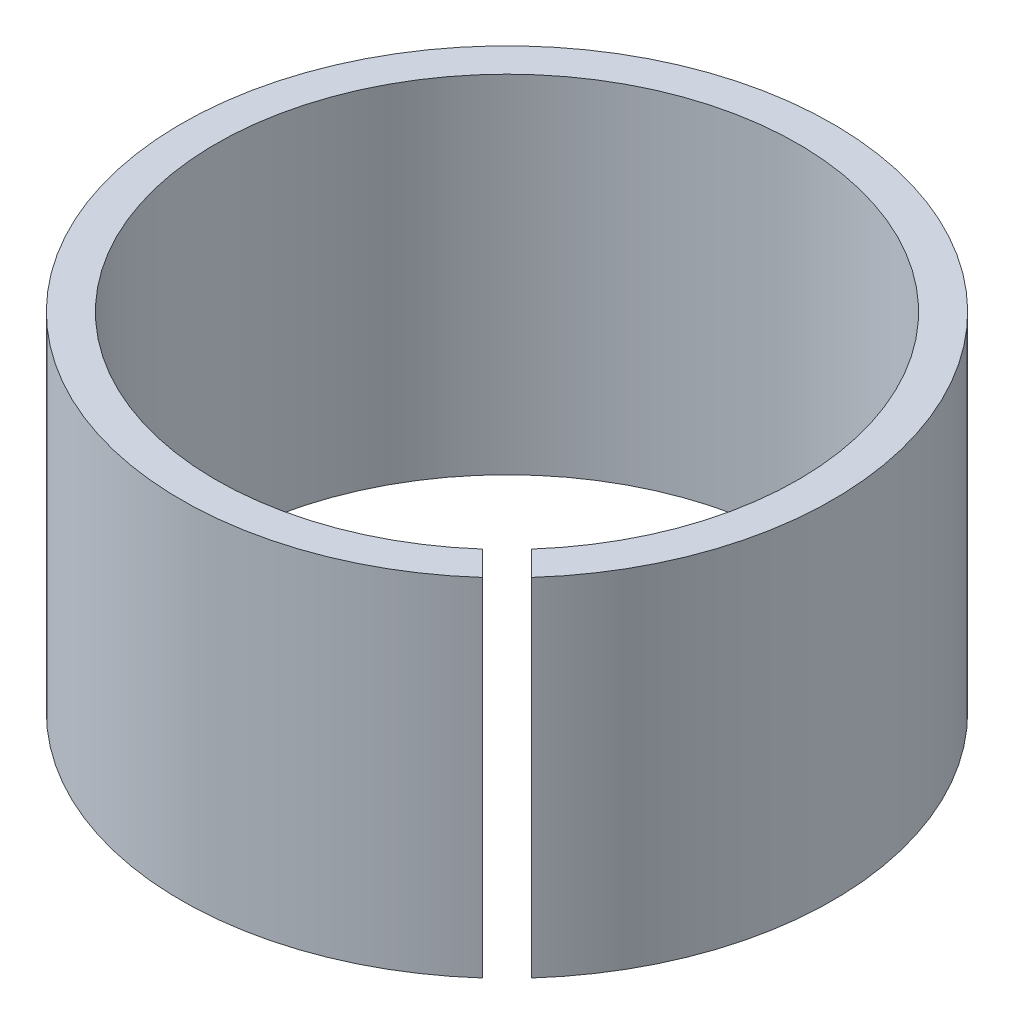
ISO-10303-21;
HEADER;
FILE_DESCRIPTION(('STEP AP214'),'2;1');
FILE_NAME('part.step','',(''),(''),'','','');
FILE_SCHEMA(('AUTOMOTIVE_DESIGN { 1 0 10303 214 1 1 1 1 }'));
ENDSEC;
DATA;
#1=APPLICATION_CONTEXT('core data for automotive mechanical design processes');
#2=APPLICATION_PROTOCOL_DEFINITION('international standard','automotive_design',2000,#1);
#3=PRODUCT_CONTEXT('',#1,'mechanical');
#4=PRODUCT('Part','Part','',(#3));
#5=PRODUCT_RELATED_PRODUCT_CATEGORY('part','',(#4));
#6=PRODUCT_DEFINITION_FORMATION('','',#4);
#7=PRODUCT_DEFINITION_CONTEXT('part definition',#1,'design');
#8=PRODUCT_DEFINITION('design','',#6,#7);
#9=PRODUCT_DEFINITION_SHAPE('','',#8);
#10=(LENGTH_UNIT() NAMED_UNIT(*) SI_UNIT(.MILLI.,.METRE.));
#11=(NAMED_UNIT(*) PLANE_ANGLE_UNIT() SI_UNIT($,.RADIAN.));
#12=(NAMED_UNIT(*) SI_UNIT($,.STERADIAN.) SOLID_ANGLE_UNIT());
#13=UNCERTAINTY_MEASURE_WITH_UNIT(LENGTH_MEASURE(1.E-05),#10,'distance_accuracy_value','');
#14=(GEOMETRIC_REPRESENTATION_CONTEXT(3) GLOBAL_UNCERTAINTY_ASSIGNED_CONTEXT((#13)) GLOBAL_UNIT_ASSIGNED_CONTEXT((#10,
#11,#12)) REPRESENTATION_CONTEXT('',''));
#15=CARTESIAN_POINT('',(0.,0.,0.));
#16=DIRECTION('',(0.,0.,1.));
#17=DIRECTION('',(1.,0.,0.));
#18=AXIS2_PLACEMENT_3D('',#15,#16,#17);
#19=CARTESIAN_POINT('',(0.,10.,0.));
#20=DIRECTION('',(0.,-1.,0.));
#21=DIRECTION('',(0.,0.,-1.));
#22=AXIS2_PLACEMENT_3D('',#19,#20,#21);
#23=CYLINDRICAL_SURFACE('',#22,9.39);
#24=CARTESIAN_POINT('',(0.,0.,0.));
#25=DIRECTION('',(0.,1.,0.));
#26=DIRECTION('',(0.,0.,1.));
#27=AXIS2_PLACEMENT_3D('',#24,#25,#26);
#28=CIRCLE('',#27,9.39);
#29=CARTESIAN_POINT('',(6.98386635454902,0.,6.27675957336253));
#30=VERTEX_POINT('',#29);
#31=CARTESIAN_POINT('',(6.2767595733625,0.,6.98386635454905));
#32=VERTEX_POINT('',#31);
#33=EDGE_CURVE('E75',#30,#32,#28,.T.);
#34=ORIENTED_EDGE('',*,*,#33,.T.);
#35=DIRECTION('',(0.,-1.,0.));
#36=VECTOR('',#35,1.);
#37=CARTESIAN_POINT('',(6.2767595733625,10.,6.98386635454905));
#38=LINE('',#37,#36);
#39=CARTESIAN_POINT('',(6.2767595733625,10.,6.98386635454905));
#40=VERTEX_POINT('',#39);
#41=EDGE_CURVE('E11',#40,#32,#38,.T.);
#42=ORIENTED_EDGE('',*,*,#41,.F.);
#43=CARTESIAN_POINT('',(0.,10.,0.));
#44=DIRECTION('',(0.,1.,0.));
#45=DIRECTION('',(0.,0.,1.));
#46=AXIS2_PLACEMENT_3D('',#43,#44,#45);
#47=CIRCLE('',#46,9.39);
#48=CARTESIAN_POINT('',(6.98386635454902,10.,6.27675957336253));
#49=VERTEX_POINT('',#48);
#50=EDGE_CURVE('E93',#49,#40,#47,.T.);
#51=ORIENTED_EDGE('',*,*,#50,.F.);
#52=DIRECTION('',(0.,-1.,0.));
#53=VECTOR('',#52,1.);
#54=CARTESIAN_POINT('',(6.98386635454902,10.,6.27675957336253));
#55=LINE('',#54,#53);
#56=EDGE_CURVE('E87',#49,#30,#55,.T.);
#57=ORIENTED_EDGE('',*,*,#56,.T.);
#58=EDGE_LOOP('',(#34,#42,#51,#57));
#59=FACE_BOUND('',#58,.T.);
#60=ADVANCED_FACE('F31',(#59),#23,.T.);
#61=CARTESIAN_POINT('',(5.56852816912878,10.,6.27563495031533));
#62=DIRECTION('',(-0.707106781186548,0.,0.707106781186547));
#63=DIRECTION('',(0.707106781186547,0.,0.707106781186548));
#64=AXIS2_PLACEMENT_3D('',#61,#62,#63);
#65=PLANE('',#64);
#66=DIRECTION('',(-0.707106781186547,0.,-0.707106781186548));
#67=VECTOR('',#66,1.);
#68=CARTESIAN_POINT('',(5.56852816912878,0.,6.27563495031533));
#69=LINE('',#68,#67);
#70=CARTESIAN_POINT('',(5.56852816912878,0.,6.27563495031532));
#71=VERTEX_POINT('',#70);
#72=EDGE_CURVE('E71',#32,#71,#69,.T.);
#73=ORIENTED_EDGE('',*,*,#72,.T.);
#74=DIRECTION('',(0.,-1.,0.));
#75=VECTOR('',#74,1.);
#76=CARTESIAN_POINT('',(5.56852816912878,10.,6.27563495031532));
#77=LINE('',#76,#75);
#78=CARTESIAN_POINT('',(5.56852816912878,10.,6.27563495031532));
#79=VERTEX_POINT('',#78);
#80=EDGE_CURVE('E38',#79,#71,#77,.T.);
#81=ORIENTED_EDGE('',*,*,#80,.F.);
#82=DIRECTION('',(-0.707106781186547,0.,-0.707106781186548));
#83=VECTOR('',#82,1.);
#84=CARTESIAN_POINT('',(5.56852816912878,10.,6.27563495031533));
#85=LINE('',#84,#83);
#86=EDGE_CURVE('E83',#40,#79,#85,.T.);
#87=ORIENTED_EDGE('',*,*,#86,.F.);
#88=ORIENTED_EDGE('',*,*,#41,.T.);
#89=EDGE_LOOP('',(#73,#81,#87,#88));
#90=FACE_BOUND('',#89,.T.);
#91=ADVANCED_FACE('F82',(#90),#65,.F.);
#92=CARTESIAN_POINT('',(0.,10.,0.));
#93=DIRECTION('',(0.,-1.,0.));
#94=DIRECTION('',(0.,0.,-1.));
#95=AXIS2_PLACEMENT_3D('',#92,#93,#94);
#96=CYLINDRICAL_SURFACE('',#95,8.39);
#97=CARTESIAN_POINT('',(0.,0.,0.));
#98=DIRECTION('',(0.,-1.,0.));
#99=DIRECTION('',(0.,0.,1.));
#100=AXIS2_PLACEMENT_3D('',#97,#98,#99);
#101=CIRCLE('',#100,8.39);
#102=CARTESIAN_POINT('',(6.2756349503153,0.,5.5685281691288));
#103=VERTEX_POINT('',#102);
#104=EDGE_CURVE('E76',#71,#103,#101,.T.);
#105=ORIENTED_EDGE('',*,*,#104,.T.);
#106=DIRECTION('',(0.,-1.,0.));
#107=VECTOR('',#106,1.);
#108=CARTESIAN_POINT('',(6.2756349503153,10.,5.5685281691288));
#109=LINE('',#108,#107);
#110=CARTESIAN_POINT('',(6.2756349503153,10.,5.5685281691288));
#111=VERTEX_POINT('',#110);
#112=EDGE_CURVE('E99',#111,#103,#109,.T.);
#113=ORIENTED_EDGE('',*,*,#112,.F.);
#114=CARTESIAN_POINT('',(0.,10.,0.));
#115=DIRECTION('',(0.,-1.,0.));
#116=DIRECTION('',(0.,0.,1.));
#117=AXIS2_PLACEMENT_3D('',#114,#115,#116);
#118=CIRCLE('',#117,8.39);
#119=EDGE_CURVE('E50',#79,#111,#118,.T.);
#120=ORIENTED_EDGE('',*,*,#119,.F.);
#121=ORIENTED_EDGE('',*,*,#80,.T.);
#122=EDGE_LOOP('',(#105,#113,#120,#121));
#123=FACE_BOUND('',#122,.T.);
#124=ADVANCED_FACE('F102',(#123),#96,.F.);
#125=CARTESIAN_POINT('',(6.2756349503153,10.,5.5685281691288));
#126=DIRECTION('',(0.70710678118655,0.,-0.707106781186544));
#127=DIRECTION('',(-0.707106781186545,0.,-0.707106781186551));
#128=AXIS2_PLACEMENT_3D('',#125,#126,#127);
#129=PLANE('',#128);
#130=DIRECTION('',(0.707106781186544,0.,0.70710678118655));
#131=VECTOR('',#130,1.);
#132=CARTESIAN_POINT('',(6.2756349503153,0.,5.5685281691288));
#133=LINE('',#132,#131);
#134=EDGE_CURVE('E91',#103,#30,#133,.T.);
#135=ORIENTED_EDGE('',*,*,#134,.T.);
#136=ORIENTED_EDGE('',*,*,#56,.F.);
#137=DIRECTION('',(0.707106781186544,0.,0.70710678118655));
#138=VECTOR('',#137,1.);
#139=CARTESIAN_POINT('',(6.2756349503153,10.,5.5685281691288));
#140=LINE('',#139,#138);
#141=EDGE_CURVE('E45',#111,#49,#140,.T.);
#142=ORIENTED_EDGE('',*,*,#141,.F.);
#143=ORIENTED_EDGE('',*,*,#112,.T.);
#144=EDGE_LOOP('',(#135,#136,#142,#143));
#145=FACE_BOUND('',#144,.T.);
#146=ADVANCED_FACE('F104',(#145),#129,.F.);
#147=CARTESIAN_POINT('',(0.,10.,0.));
#148=DIRECTION('',(0.,1.,0.));
#149=DIRECTION('',(0.,0.,1.));
#150=AXIS2_PLACEMENT_3D('',#147,#148,#149);
#151=PLANE('',#150);
#152=ORIENTED_EDGE('',*,*,#50,.T.);
#153=ORIENTED_EDGE('',*,*,#86,.T.);
#154=ORIENTED_EDGE('',*,*,#119,.T.);
#155=ORIENTED_EDGE('',*,*,#141,.T.);
#156=EDGE_LOOP('',(#152,#153,#154,#155));
#157=FACE_BOUND('',#156,.T.);
#158=ADVANCED_FACE('F105',(#157),#151,.T.);
#159=CARTESIAN_POINT('',(0.,0.,0.));
#160=DIRECTION('',(0.,1.,0.));
#161=DIRECTION('',(0.,0.,1.));
#162=AXIS2_PLACEMENT_3D('',#159,#160,#161);
#163=PLANE('',#162);
#164=ORIENTED_EDGE('',*,*,#33,.F.);
#165=ORIENTED_EDGE('',*,*,#134,.F.);
#166=ORIENTED_EDGE('',*,*,#104,.F.);
#167=ORIENTED_EDGE('',*,*,#72,.F.);
#168=EDGE_LOOP('',(#164,#165,#166,#167));
#169=FACE_BOUND('',#168,.T.);
#170=ADVANCED_FACE('F72',(#169),#163,.F.);
#171=CLOSED_SHELL('',(#60,#91,#124,#146,#158,#170));
#172=MANIFOLD_SOLID_BREP('B2',#171);
#173=ADVANCED_BREP_SHAPE_REPRESENTATION('',(#18,#172),#14);
#174=SHAPE_DEFINITION_REPRESENTATION(#9,#173);
ENDSEC;
END-ISO-10303-21;
